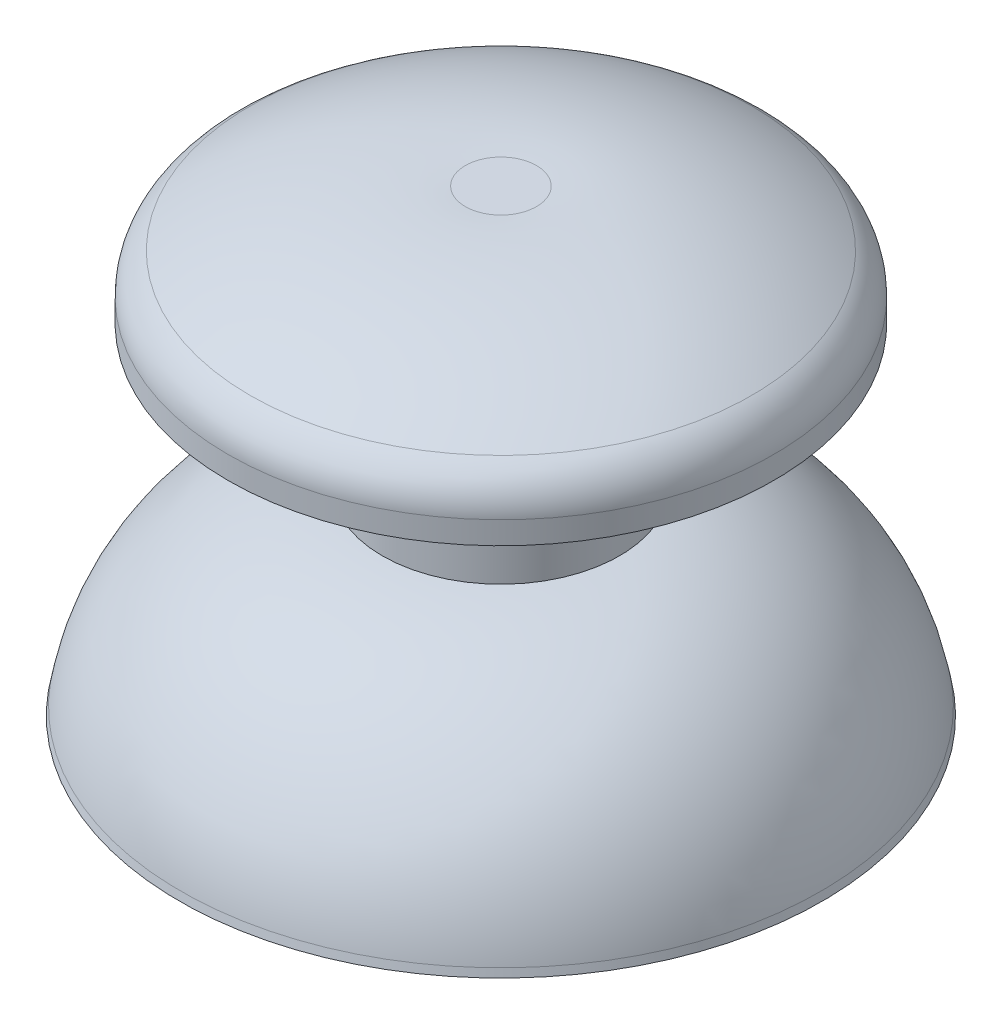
from build123d import *


with BuildPart() as part:
    # Esquisse1 → R_volution3 (revolve)
    with BuildSketch(Plane.XY, mode=Mode.PRIVATE) as r_volution3_sk:
        with BuildLine():
            ThreePointArc((1.5, 62.59979798), (6.217396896, 62.120789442), (10.57, 60.23979798))
            ThreePointArc((10.57, 60.23979798), (11.252212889, 59.514329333), (11.5, 58.54979798))
            Line((11.5, 58.54979798), (11.5, 57.59979798))
            Line((11.5, 57.59979798), (5, 57.59979798))
            Line((5, 57.59979798), (5, 51.59979798))
            ThreePointArc((5, 51.59979798), (10.562518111, 48.999496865), (13.485945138, 43.59979798))
            Line((13.485945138, 43.59979798), (13.55, 43.26979798))
            Line((13.55, 43.26979798), (12.04, 43.26979798))
            Line((12.04, 43.26979798), (11.975945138, 43.59979798))
            ThreePointArc((11.975945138, 43.59979798), (10.843812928, 46.341365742), (8.82, 48.50979798))
            Line((8.82, 48.50979798), (1.61, 48.50979798))
            Line((1.61, 48.50979798), (1.61, 53.42979798))
            Line((1.61, 53.42979798), (0, 53.42979798))
            Line((0, 53.42979798), (0, 62.59979798))
            Line((0, 62.59979798), (1.5, 62.59979798))
        make_face()
    revolve(r_volution3_sk.sketch.rotate(Axis((0, 0, 0), (0, 1, 0)), 90), axis=Axis((0, 0, 0), (0, 1, 0)))


solid = part.part
